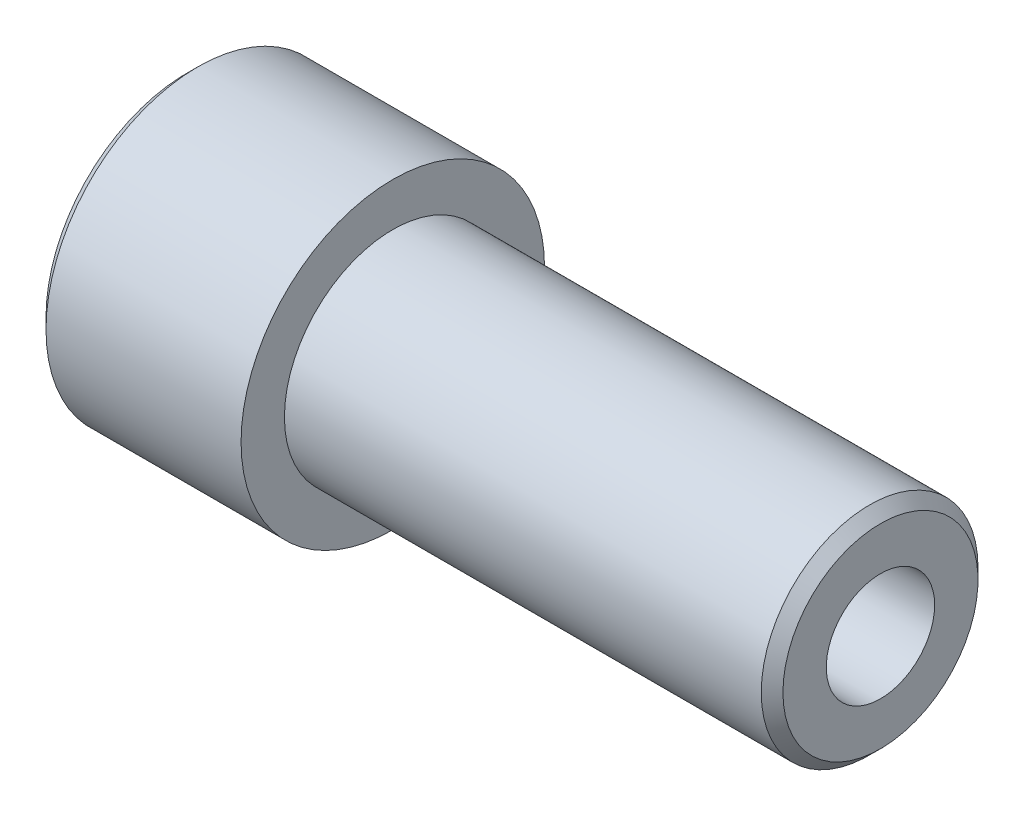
from build123d import *

# Parameters (mm, degrees)
TROU_TARAUD_M61_D     = 5
TROU_TARAUD_M61_DEPTH = 20
TROU_TARAUD_M61_TIP   = 1.502151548
CHANFREIN1_SIZE       = 0.5


with BuildPart() as part:
    # Esquisse1 → R_volution1 (revolve)
    with BuildSketch(Plane.XY, mode=Mode.PRIVATE) as r_volution1_sk:
        Polygon((0, 0), (0, 7), (9.5, 7), (9.5, 5), (32, 5), (32, 0), align=None)
    revolve(r_volution1_sk.sketch.rotate(Axis((0, 0, 0), (1, 0, 0)), 90), axis=Axis((0, 0, 0), (1, 0, 0)))

    # Trou taraud_ M61
    with Locations(Plane(origin=(32, 0, 0), x_dir=(0, 0, -1), z_dir=(1, 0, 0))):
        with Locations((0, 0)):
            Hole(TROU_TARAUD_M61_D / 2, depth=TROU_TARAUD_M61_DEPTH)
            with Locations((0, 0, -(TROU_TARAUD_M61_DEPTH + TROU_TARAUD_M61_TIP / 2))):  # 118° drill point
                Cone(0, TROU_TARAUD_M61_D / 2, TROU_TARAUD_M61_TIP, mode=Mode.SUBTRACT)

    # Chanfrein1
    chanfrein1_edges = [part.edges().sort_by_distance(p)[0] for p in [
        (32, 0, -5),
        (0, 0, -7),
    ]]
    chamfer(chanfrein1_edges, length=CHANFREIN1_SIZE)


solid = part.part
